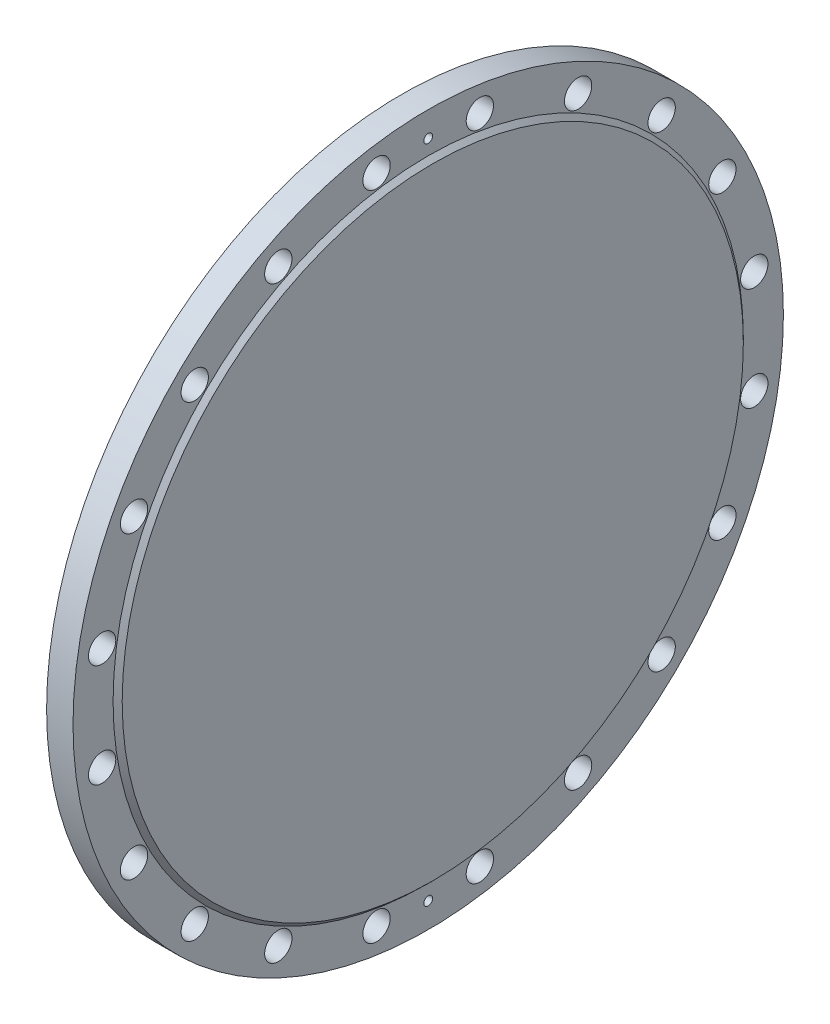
ISO-10303-21;
HEADER;
FILE_DESCRIPTION(('STEP AP214'),'2;1');
FILE_NAME('part.step','',(''),(''),'','','');
FILE_SCHEMA(('AUTOMOTIVE_DESIGN { 1 0 10303 214 1 1 1 1 }'));
ENDSEC;
DATA;
#1=APPLICATION_CONTEXT('core data for automotive mechanical design processes');
#2=APPLICATION_PROTOCOL_DEFINITION('international standard','automotive_design',2000,#1);
#3=PRODUCT_CONTEXT('',#1,'mechanical');
#4=PRODUCT('Part','Part','',(#3));
#5=PRODUCT_RELATED_PRODUCT_CATEGORY('part','',(#4));
#6=PRODUCT_DEFINITION_FORMATION('','',#4);
#7=PRODUCT_DEFINITION_CONTEXT('part definition',#1,'design');
#8=PRODUCT_DEFINITION('design','',#6,#7);
#9=PRODUCT_DEFINITION_SHAPE('','',#8);
#10=(LENGTH_UNIT() NAMED_UNIT(*) SI_UNIT(.MILLI.,.METRE.));
#11=(NAMED_UNIT(*) PLANE_ANGLE_UNIT() SI_UNIT($,.RADIAN.));
#12=(NAMED_UNIT(*) SI_UNIT($,.STERADIAN.) SOLID_ANGLE_UNIT());
#13=UNCERTAINTY_MEASURE_WITH_UNIT(LENGTH_MEASURE(1.E-05),#10,'distance_accuracy_value','');
#14=(GEOMETRIC_REPRESENTATION_CONTEXT(3) GLOBAL_UNCERTAINTY_ASSIGNED_CONTEXT((#13)) GLOBAL_UNIT_ASSIGNED_CONTEXT((#10,
#11,#12)) REPRESENTATION_CONTEXT('',''));
#15=CARTESIAN_POINT('',(0.,0.,0.));
#16=DIRECTION('',(0.,0.,1.));
#17=DIRECTION('',(1.,0.,0.));
#18=AXIS2_PLACEMENT_3D('',#15,#16,#17);
#19=CARTESIAN_POINT('',(-816.,390.,0.));
#20=DIRECTION('',(-1.,0.,0.));
#21=DIRECTION('',(0.,0.,1.));
#22=AXIS2_PLACEMENT_3D('',#19,#20,#21);
#23=PLANE('',#22);
#24=CARTESIAN_POINT('',(-816.,-362.5,0.));
#25=DIRECTION('',(-1.,0.,0.));
#26=DIRECTION('',(0.,0.,1.));
#27=AXIS2_PLACEMENT_3D('',#24,#25,#26);
#28=CIRCLE('',#27,4.80000000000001);
#29=CARTESIAN_POINT('',(-816.,-362.5,4.80000000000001));
#30=VERTEX_POINT('',#29);
#31=EDGE_CURVE('E151',#30,#30,#28,.T.);
#32=ORIENTED_EDGE('',*,*,#31,.F.);
#33=EDGE_LOOP('',(#32));
#34=FACE_BOUND('',#33,.T.);
#35=CARTESIAN_POINT('',(-816.,362.5,0.));
#36=DIRECTION('',(-1.,0.,0.));
#37=DIRECTION('',(0.,0.,1.));
#38=AXIS2_PLACEMENT_3D('',#35,#36,#37);
#39=CIRCLE('',#38,4.80000000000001);
#40=CARTESIAN_POINT('',(-816.,362.5,4.80000000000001));
#41=VERTEX_POINT('',#40);
#42=EDGE_CURVE('E141',#41,#41,#39,.T.);
#43=ORIENTED_EDGE('',*,*,#42,.F.);
#44=EDGE_LOOP('',(#43));
#45=FACE_BOUND('',#44,.T.);
#46=CARTESIAN_POINT('',(-816.,322.98986501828,164.571556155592));
#47=DIRECTION('',(-1.,0.,0.));
#48=DIRECTION('',(0.,0.,1.));
#49=AXIS2_PLACEMENT_3D('',#46,#47,#48);
#50=CIRCLE('',#49,15.);
#51=CARTESIAN_POINT('',(-816.,322.98986501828,179.571556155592));
#52=VERTEX_POINT('',#51);
#53=EDGE_CURVE('E138',#52,#52,#50,.T.);
#54=ORIENTED_EDGE('',*,*,#53,.F.);
#55=EDGE_LOOP('',(#54));
#56=FACE_BOUND('',#55,.T.);
#57=CARTESIAN_POINT('',(-816.,358.037023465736,56.7074935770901));
#58=DIRECTION('',(-1.,0.,0.));
#59=DIRECTION('',(0.,0.,1.));
#60=AXIS2_PLACEMENT_3D('',#57,#58,#59);
#61=CIRCLE('',#60,15.);
#62=CARTESIAN_POINT('',(-816.,358.037023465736,71.7074935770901));
#63=VERTEX_POINT('',#62);
#64=EDGE_CURVE('E135',#63,#63,#61,.T.);
#65=ORIENTED_EDGE('',*,*,#64,.F.);
#66=EDGE_LOOP('',(#65));
#67=FACE_BOUND('',#66,.T.);
#68=CARTESIAN_POINT('',(-816.,358.037023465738,-56.7074935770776));
#69=DIRECTION('',(-1.,0.,0.));
#70=DIRECTION('',(0.,0.,1.));
#71=AXIS2_PLACEMENT_3D('',#68,#69,#70);
#72=CIRCLE('',#71,15.);
#73=CARTESIAN_POINT('',(-816.,358.037023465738,-41.7074935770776));
#74=VERTEX_POINT('',#73);
#75=EDGE_CURVE('E131',#74,#74,#72,.T.);
#76=ORIENTED_EDGE('',*,*,#75,.F.);
#77=EDGE_LOOP('',(#76));
#78=FACE_BOUND('',#77,.T.);
#79=CARTESIAN_POINT('',(-816.,322.989865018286,-164.571556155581));
#80=DIRECTION('',(-1.,0.,0.));
#81=DIRECTION('',(0.,0.,1.));
#82=AXIS2_PLACEMENT_3D('',#79,#80,#81);
#83=CIRCLE('',#82,15.);
#84=CARTESIAN_POINT('',(-816.,322.989865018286,-149.571556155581));
#85=VERTEX_POINT('',#84);
#86=EDGE_CURVE('E127',#85,#85,#83,.T.);
#87=ORIENTED_EDGE('',*,*,#86,.F.);
#88=EDGE_LOOP('',(#87));
#89=FACE_BOUND('',#88,.T.);
#90=CARTESIAN_POINT('',(-816.,256.326208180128,-256.326208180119));
#91=DIRECTION('',(-1.,0.,0.));
#92=DIRECTION('',(0.,0.,1.));
#93=AXIS2_PLACEMENT_3D('',#90,#91,#92);
#94=CIRCLE('',#93,15.);
#95=CARTESIAN_POINT('',(-816.,256.326208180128,-241.326208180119));
#96=VERTEX_POINT('',#95);
#97=EDGE_CURVE('E123',#96,#96,#94,.T.);
#98=ORIENTED_EDGE('',*,*,#97,.F.);
#99=EDGE_LOOP('',(#98));
#100=FACE_BOUND('',#99,.T.);
#101=CARTESIAN_POINT('',(-816.,164.571556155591,-322.989865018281));
#102=DIRECTION('',(-1.,0.,0.));
#103=DIRECTION('',(0.,0.,1.));
#104=AXIS2_PLACEMENT_3D('',#101,#102,#103);
#105=CIRCLE('',#104,15.);
#106=CARTESIAN_POINT('',(-816.,164.571556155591,-307.989865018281));
#107=VERTEX_POINT('',#106);
#108=EDGE_CURVE('E119',#107,#107,#105,.T.);
#109=ORIENTED_EDGE('',*,*,#108,.F.);
#110=EDGE_LOOP('',(#109));
#111=FACE_BOUND('',#110,.T.);
#112=CARTESIAN_POINT('',(-816.,56.7074935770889,-358.037023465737));
#113=DIRECTION('',(-1.,0.,0.));
#114=DIRECTION('',(0.,0.,1.));
#115=AXIS2_PLACEMENT_3D('',#112,#113,#114);
#116=CIRCLE('',#115,15.0000000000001);
#117=CARTESIAN_POINT('',(-816.,56.7074935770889,-343.037023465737));
#118=VERTEX_POINT('',#117);
#119=EDGE_CURVE('E115',#118,#118,#116,.T.);
#120=ORIENTED_EDGE('',*,*,#119,.F.);
#121=EDGE_LOOP('',(#120));
#122=FACE_BOUND('',#121,.T.);
#123=CARTESIAN_POINT('',(-816.,-56.7074935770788,-358.037023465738));
#124=DIRECTION('',(-1.,0.,0.));
#125=DIRECTION('',(0.,0.,1.));
#126=AXIS2_PLACEMENT_3D('',#123,#124,#125);
#127=CIRCLE('',#126,15.0000000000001);
#128=CARTESIAN_POINT('',(-816.,-56.7074935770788,-343.037023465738));
#129=VERTEX_POINT('',#128);
#130=EDGE_CURVE('E111',#129,#129,#127,.T.);
#131=ORIENTED_EDGE('',*,*,#130,.F.);
#132=EDGE_LOOP('',(#131));
#133=FACE_BOUND('',#132,.T.);
#134=CARTESIAN_POINT('',(-816.,-164.571556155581,-322.989865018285));
#135=DIRECTION('',(-1.,0.,0.));
#136=DIRECTION('',(0.,0.,1.));
#137=AXIS2_PLACEMENT_3D('',#134,#135,#136);
#138=CIRCLE('',#137,15.);
#139=CARTESIAN_POINT('',(-816.,-164.571556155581,-307.989865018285));
#140=VERTEX_POINT('',#139);
#141=EDGE_CURVE('E107',#140,#140,#138,.T.);
#142=ORIENTED_EDGE('',*,*,#141,.F.);
#143=EDGE_LOOP('',(#142));
#144=FACE_BOUND('',#143,.T.);
#145=CARTESIAN_POINT('',(-816.,-256.32620818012,-256.326208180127));
#146=DIRECTION('',(-1.,0.,0.));
#147=DIRECTION('',(0.,0.,1.));
#148=AXIS2_PLACEMENT_3D('',#145,#146,#147);
#149=CIRCLE('',#148,15.);
#150=CARTESIAN_POINT('',(-816.,-256.32620818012,-241.326208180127));
#151=VERTEX_POINT('',#150);
#152=EDGE_CURVE('E103',#151,#151,#149,.T.);
#153=ORIENTED_EDGE('',*,*,#152,.F.);
#154=EDGE_LOOP('',(#153));
#155=FACE_BOUND('',#154,.T.);
#156=CARTESIAN_POINT('',(-816.,-322.989865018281,-164.571556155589));
#157=DIRECTION('',(-1.,0.,0.));
#158=DIRECTION('',(0.,0.,1.));
#159=AXIS2_PLACEMENT_3D('',#156,#157,#158);
#160=CIRCLE('',#159,15.);
#161=CARTESIAN_POINT('',(-816.,-322.989865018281,-149.571556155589));
#162=VERTEX_POINT('',#161);
#163=EDGE_CURVE('E99',#162,#162,#160,.T.);
#164=ORIENTED_EDGE('',*,*,#163,.F.);
#165=EDGE_LOOP('',(#164));
#166=FACE_BOUND('',#165,.T.);
#167=CARTESIAN_POINT('',(-816.,-358.037023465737,-56.7074935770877));
#168=DIRECTION('',(-1.,0.,0.));
#169=DIRECTION('',(0.,0.,1.));
#170=AXIS2_PLACEMENT_3D('',#167,#168,#169);
#171=CIRCLE('',#170,15.);
#172=CARTESIAN_POINT('',(-816.,-358.037023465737,-41.7074935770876));
#173=VERTEX_POINT('',#172);
#174=EDGE_CURVE('E95',#173,#173,#171,.T.);
#175=ORIENTED_EDGE('',*,*,#174,.F.);
#176=EDGE_LOOP('',(#175));
#177=FACE_BOUND('',#176,.T.);
#178=CARTESIAN_POINT('',(-816.,-358.037023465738,56.7074935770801));
#179=DIRECTION('',(-1.,0.,0.));
#180=DIRECTION('',(0.,0.,1.));
#181=AXIS2_PLACEMENT_3D('',#178,#179,#180);
#182=CIRCLE('',#181,15.);
#183=CARTESIAN_POINT('',(-816.,-358.037023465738,71.7074935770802));
#184=VERTEX_POINT('',#183);
#185=EDGE_CURVE('E91',#184,#184,#182,.T.);
#186=ORIENTED_EDGE('',*,*,#185,.F.);
#187=EDGE_LOOP('',(#186));
#188=FACE_BOUND('',#187,.T.);
#189=CARTESIAN_POINT('',(-816.,-322.989865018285,164.571556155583));
#190=DIRECTION('',(-1.,0.,0.));
#191=DIRECTION('',(0.,0.,1.));
#192=AXIS2_PLACEMENT_3D('',#189,#190,#191);
#193=CIRCLE('',#192,15.);
#194=CARTESIAN_POINT('',(-816.,-322.989865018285,179.571556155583));
#195=VERTEX_POINT('',#194);
#196=EDGE_CURVE('E87',#195,#195,#193,.T.);
#197=ORIENTED_EDGE('',*,*,#196,.F.);
#198=EDGE_LOOP('',(#197));
#199=FACE_BOUND('',#198,.T.);
#200=CARTESIAN_POINT('',(-816.,-256.326208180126,256.326208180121));
#201=DIRECTION('',(-1.,0.,0.));
#202=DIRECTION('',(0.,0.,1.));
#203=AXIS2_PLACEMENT_3D('',#200,#201,#202);
#204=CIRCLE('',#203,15.0000000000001);
#205=CARTESIAN_POINT('',(-816.,-256.326208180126,271.326208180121));
#206=VERTEX_POINT('',#205);
#207=EDGE_CURVE('E83',#206,#206,#204,.T.);
#208=ORIENTED_EDGE('',*,*,#207,.F.);
#209=EDGE_LOOP('',(#208));
#210=FACE_BOUND('',#209,.T.);
#211=CARTESIAN_POINT('',(-816.,-164.571556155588,322.989865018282));
#212=DIRECTION('',(-1.,0.,0.));
#213=DIRECTION('',(0.,0.,1.));
#214=AXIS2_PLACEMENT_3D('',#211,#212,#213);
#215=CIRCLE('',#214,15.);
#216=CARTESIAN_POINT('',(-816.,-164.571556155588,337.989865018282));
#217=VERTEX_POINT('',#216);
#218=EDGE_CURVE('E79',#217,#217,#215,.T.);
#219=ORIENTED_EDGE('',*,*,#218,.F.);
#220=EDGE_LOOP('',(#219));
#221=FACE_BOUND('',#220,.T.);
#222=CARTESIAN_POINT('',(-816.,-56.7074935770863,358.037023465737));
#223=DIRECTION('',(-1.,0.,0.));
#224=DIRECTION('',(0.,0.,1.));
#225=AXIS2_PLACEMENT_3D('',#222,#223,#224);
#226=CIRCLE('',#225,15.);
#227=CARTESIAN_POINT('',(-816.,-56.7074935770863,373.037023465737));
#228=VERTEX_POINT('',#227);
#229=EDGE_CURVE('E75',#228,#228,#226,.T.);
#230=ORIENTED_EDGE('',*,*,#229,.F.);
#231=EDGE_LOOP('',(#230));
#232=FACE_BOUND('',#231,.T.);
#233=CARTESIAN_POINT('',(-816.,56.7074935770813,358.037023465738));
#234=DIRECTION('',(-1.,0.,0.));
#235=DIRECTION('',(0.,0.,1.));
#236=AXIS2_PLACEMENT_3D('',#233,#234,#235);
#237=CIRCLE('',#236,15.);
#238=CARTESIAN_POINT('',(-816.,56.7074935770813,373.037023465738));
#239=VERTEX_POINT('',#238);
#240=EDGE_CURVE('E71',#239,#239,#237,.T.);
#241=ORIENTED_EDGE('',*,*,#240,.F.);
#242=EDGE_LOOP('',(#241));
#243=FACE_BOUND('',#242,.T.);
#244=CARTESIAN_POINT('',(-816.,164.571556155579,322.989865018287));
#245=DIRECTION('',(-1.,0.,0.));
#246=DIRECTION('',(0.,0.,1.));
#247=AXIS2_PLACEMENT_3D('',#244,#245,#246);
#248=CIRCLE('',#247,15.0000000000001);
#249=CARTESIAN_POINT('',(-816.,164.571556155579,337.989865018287));
#250=VERTEX_POINT('',#249);
#251=EDGE_CURVE('E67',#250,#250,#248,.T.);
#252=ORIENTED_EDGE('',*,*,#251,.F.);
#253=EDGE_LOOP('',(#252));
#254=FACE_BOUND('',#253,.T.);
#255=CARTESIAN_POINT('',(-816.,256.326208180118,256.326208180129));
#256=DIRECTION('',(-1.,0.,0.));
#257=DIRECTION('',(0.,0.,1.));
#258=AXIS2_PLACEMENT_3D('',#255,#256,#257);
#259=CIRCLE('',#258,15.);
#260=CARTESIAN_POINT('',(-816.,256.326208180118,271.326208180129));
#261=VERTEX_POINT('',#260);
#262=EDGE_CURVE('E63',#261,#261,#259,.T.);
#263=ORIENTED_EDGE('',*,*,#262,.F.);
#264=EDGE_LOOP('',(#263));
#265=FACE_BOUND('',#264,.T.);
#266=CARTESIAN_POINT('',(-816.,0.,0.));
#267=DIRECTION('',(1.,0.,0.));
#268=DIRECTION('',(0.,0.,-1.));
#269=AXIS2_PLACEMENT_3D('',#266,#267,#268);
#270=CIRCLE('',#269,390.);
#271=CARTESIAN_POINT('',(-816.,0.,-390.));
#272=VERTEX_POINT('',#271);
#273=EDGE_CURVE('E62',#272,#272,#270,.T.);
#274=ORIENTED_EDGE('',*,*,#273,.F.);
#275=EDGE_LOOP('',(#274));
#276=FACE_BOUND('',#275,.T.);
#277=ADVANCED_FACE('F43',(#34,#45,#56,#67,#78,#89,#100,#111,#122,#133,#144,#155,#166,#177,#188,
#199,#210,#221,#232,#243,#254,#265,#276),#23,.T.);
#278=CARTESIAN_POINT('',(-782.,341.,0.));
#279=DIRECTION('',(1.,0.,0.));
#280=DIRECTION('',(0.,0.,-1.));
#281=AXIS2_PLACEMENT_3D('',#278,#279,#280);
#282=PLANE('',#281);
#283=CARTESIAN_POINT('',(-782.,0.,0.));
#284=DIRECTION('',(1.,0.,0.));
#285=DIRECTION('',(0.,0.,-1.));
#286=AXIS2_PLACEMENT_3D('',#283,#284,#285);
#287=CIRCLE('',#286,341.);
#288=CARTESIAN_POINT('',(-782.,0.,-341.));
#289=VERTEX_POINT('',#288);
#290=EDGE_CURVE('E12',#289,#289,#287,.T.);
#291=ORIENTED_EDGE('',*,*,#290,.T.);
#292=EDGE_LOOP('',(#291));
#293=FACE_BOUND('',#292,.T.);
#294=ADVANCED_FACE('F215',(#293),#282,.T.);
#295=CARTESIAN_POINT('',(-782.,0.,0.));
#296=DIRECTION('',(-1.,0.,0.));
#297=DIRECTION('',(0.,0.,1.));
#298=AXIS2_PLACEMENT_3D('',#295,#296,#297);
#299=CONICAL_SURFACE('',#298,341.,0.785398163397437);
#300=CARTESIAN_POINT('',(-787.,0.,0.));
#301=DIRECTION('',(1.,0.,0.));
#302=DIRECTION('',(0.,0.,-1.));
#303=AXIS2_PLACEMENT_3D('',#300,#301,#302);
#304=CIRCLE('',#303,346.);
#305=CARTESIAN_POINT('',(-787.,0.,-346.));
#306=VERTEX_POINT('',#305);
#307=EDGE_CURVE('E50',#306,#306,#304,.T.);
#308=ORIENTED_EDGE('',*,*,#307,.T.);
#309=EDGE_LOOP('',(#308));
#310=FACE_BOUND('',#309,.T.);
#311=ORIENTED_EDGE('',*,*,#290,.F.);
#312=EDGE_LOOP('',(#311));
#313=FACE_BOUND('',#312,.T.);
#314=ADVANCED_FACE('F211',(#310,#313),#299,.T.);
#315=CARTESIAN_POINT('',(-787.,390.,0.));
#316=DIRECTION('',(1.,0.,0.));
#317=DIRECTION('',(0.,0.,-1.));
#318=AXIS2_PLACEMENT_3D('',#315,#316,#317);
#319=PLANE('',#318);
#320=CARTESIAN_POINT('',(-787.,-362.5,0.));
#321=DIRECTION('',(1.,0.,0.));
#322=DIRECTION('',(0.,0.,-1.));
#323=AXIS2_PLACEMENT_3D('',#320,#321,#322);
#324=CIRCLE('',#323,4.80000000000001);
#325=CARTESIAN_POINT('',(-787.,-362.5,-4.80000000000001));
#326=VERTEX_POINT('',#325);
#327=EDGE_CURVE('E46',#326,#326,#324,.T.);
#328=ORIENTED_EDGE('',*,*,#327,.F.);
#329=EDGE_LOOP('',(#328));
#330=FACE_BOUND('',#329,.T.);
#331=CARTESIAN_POINT('',(-787.,362.5,0.));
#332=DIRECTION('',(1.,0.,0.));
#333=DIRECTION('',(0.,0.,-1.));
#334=AXIS2_PLACEMENT_3D('',#331,#332,#333);
#335=CIRCLE('',#334,4.80000000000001);
#336=CARTESIAN_POINT('',(-787.,362.5,-4.80000000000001));
#337=VERTEX_POINT('',#336);
#338=EDGE_CURVE('E139',#337,#337,#335,.T.);
#339=ORIENTED_EDGE('',*,*,#338,.F.);
#340=EDGE_LOOP('',(#339));
#341=FACE_BOUND('',#340,.T.);
#342=CARTESIAN_POINT('',(-787.,322.98986501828,164.571556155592));
#343=DIRECTION('',(1.,0.,0.));
#344=DIRECTION('',(0.,0.,-1.));
#345=AXIS2_PLACEMENT_3D('',#342,#343,#344);
#346=CIRCLE('',#345,15.);
#347=CARTESIAN_POINT('',(-787.,322.98986501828,149.571556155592));
#348=VERTEX_POINT('',#347);
#349=EDGE_CURVE('E136',#348,#348,#346,.T.);
#350=ORIENTED_EDGE('',*,*,#349,.F.);
#351=EDGE_LOOP('',(#350));
#352=FACE_BOUND('',#351,.T.);
#353=CARTESIAN_POINT('',(-787.,358.037023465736,56.7074935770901));
#354=DIRECTION('',(1.,0.,0.));
#355=DIRECTION('',(0.,0.,-1.));
#356=AXIS2_PLACEMENT_3D('',#353,#354,#355);
#357=CIRCLE('',#356,15.);
#358=CARTESIAN_POINT('',(-787.,358.037023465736,41.70749357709));
#359=VERTEX_POINT('',#358);
#360=EDGE_CURVE('E132',#359,#359,#357,.T.);
#361=ORIENTED_EDGE('',*,*,#360,.F.);
#362=EDGE_LOOP('',(#361));
#363=FACE_BOUND('',#362,.T.);
#364=CARTESIAN_POINT('',(-787.,358.037023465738,-56.7074935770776));
#365=DIRECTION('',(1.,0.,0.));
#366=DIRECTION('',(0.,0.,-1.));
#367=AXIS2_PLACEMENT_3D('',#364,#365,#366);
#368=CIRCLE('',#367,15.);
#369=CARTESIAN_POINT('',(-787.,358.037023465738,-71.7074935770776));
#370=VERTEX_POINT('',#369);
#371=EDGE_CURVE('E128',#370,#370,#368,.T.);
#372=ORIENTED_EDGE('',*,*,#371,.F.);
#373=EDGE_LOOP('',(#372));
#374=FACE_BOUND('',#373,.T.);
#375=CARTESIAN_POINT('',(-787.,322.989865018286,-164.571556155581));
#376=DIRECTION('',(1.,0.,0.));
#377=DIRECTION('',(0.,0.,-1.));
#378=AXIS2_PLACEMENT_3D('',#375,#376,#377);
#379=CIRCLE('',#378,15.);
#380=CARTESIAN_POINT('',(-787.,322.989865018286,-179.571556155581));
#381=VERTEX_POINT('',#380);
#382=EDGE_CURVE('E124',#381,#381,#379,.T.);
#383=ORIENTED_EDGE('',*,*,#382,.F.);
#384=EDGE_LOOP('',(#383));
#385=FACE_BOUND('',#384,.T.);
#386=CARTESIAN_POINT('',(-787.,256.326208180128,-256.326208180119));
#387=DIRECTION('',(1.,0.,0.));
#388=DIRECTION('',(0.,0.,-1.));
#389=AXIS2_PLACEMENT_3D('',#386,#387,#388);
#390=CIRCLE('',#389,15.);
#391=CARTESIAN_POINT('',(-787.,256.326208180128,-271.326208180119));
#392=VERTEX_POINT('',#391);
#393=EDGE_CURVE('E120',#392,#392,#390,.T.);
#394=ORIENTED_EDGE('',*,*,#393,.F.);
#395=EDGE_LOOP('',(#394));
#396=FACE_BOUND('',#395,.T.);
#397=CARTESIAN_POINT('',(-787.,164.571556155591,-322.989865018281));
#398=DIRECTION('',(1.,0.,0.));
#399=DIRECTION('',(0.,0.,-1.));
#400=AXIS2_PLACEMENT_3D('',#397,#398,#399);
#401=CIRCLE('',#400,15.);
#402=CARTESIAN_POINT('',(-787.,164.571556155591,-337.989865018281));
#403=VERTEX_POINT('',#402);
#404=EDGE_CURVE('E116',#403,#403,#401,.T.);
#405=ORIENTED_EDGE('',*,*,#404,.F.);
#406=EDGE_LOOP('',(#405));
#407=FACE_BOUND('',#406,.T.);
#408=CARTESIAN_POINT('',(-787.,56.7074935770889,-358.037023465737));
#409=DIRECTION('',(1.,0.,0.));
#410=DIRECTION('',(0.,0.,-1.));
#411=AXIS2_PLACEMENT_3D('',#408,#409,#410);
#412=CIRCLE('',#411,15.0000000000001);
#413=CARTESIAN_POINT('',(-787.,56.7074935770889,-373.037023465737));
#414=VERTEX_POINT('',#413);
#415=EDGE_CURVE('E112',#414,#414,#412,.T.);
#416=ORIENTED_EDGE('',*,*,#415,.F.);
#417=EDGE_LOOP('',(#416));
#418=FACE_BOUND('',#417,.T.);
#419=CARTESIAN_POINT('',(-787.,-56.7074935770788,-358.037023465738));
#420=DIRECTION('',(1.,0.,0.));
#421=DIRECTION('',(0.,0.,-1.));
#422=AXIS2_PLACEMENT_3D('',#419,#420,#421);
#423=CIRCLE('',#422,15.0000000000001);
#424=CARTESIAN_POINT('',(-787.,-56.7074935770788,-373.037023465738));
#425=VERTEX_POINT('',#424);
#426=EDGE_CURVE('E108',#425,#425,#423,.T.);
#427=ORIENTED_EDGE('',*,*,#426,.F.);
#428=EDGE_LOOP('',(#427));
#429=FACE_BOUND('',#428,.T.);
#430=CARTESIAN_POINT('',(-787.,-164.571556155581,-322.989865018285));
#431=DIRECTION('',(1.,0.,0.));
#432=DIRECTION('',(0.,0.,-1.));
#433=AXIS2_PLACEMENT_3D('',#430,#431,#432);
#434=CIRCLE('',#433,15.);
#435=CARTESIAN_POINT('',(-787.,-164.571556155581,-337.989865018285));
#436=VERTEX_POINT('',#435);
#437=EDGE_CURVE('E104',#436,#436,#434,.T.);
#438=ORIENTED_EDGE('',*,*,#437,.F.);
#439=EDGE_LOOP('',(#438));
#440=FACE_BOUND('',#439,.T.);
#441=CARTESIAN_POINT('',(-787.,-256.32620818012,-256.326208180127));
#442=DIRECTION('',(1.,0.,0.));
#443=DIRECTION('',(0.,0.,-1.));
#444=AXIS2_PLACEMENT_3D('',#441,#442,#443);
#445=CIRCLE('',#444,15.);
#446=CARTESIAN_POINT('',(-787.,-256.32620818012,-271.326208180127));
#447=VERTEX_POINT('',#446);
#448=EDGE_CURVE('E100',#447,#447,#445,.T.);
#449=ORIENTED_EDGE('',*,*,#448,.F.);
#450=EDGE_LOOP('',(#449));
#451=FACE_BOUND('',#450,.T.);
#452=CARTESIAN_POINT('',(-787.,-322.989865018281,-164.571556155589));
#453=DIRECTION('',(1.,0.,0.));
#454=DIRECTION('',(0.,0.,-1.));
#455=AXIS2_PLACEMENT_3D('',#452,#453,#454);
#456=CIRCLE('',#455,15.);
#457=CARTESIAN_POINT('',(-787.,-322.989865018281,-179.571556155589));
#458=VERTEX_POINT('',#457);
#459=EDGE_CURVE('E96',#458,#458,#456,.T.);
#460=ORIENTED_EDGE('',*,*,#459,.F.);
#461=EDGE_LOOP('',(#460));
#462=FACE_BOUND('',#461,.T.);
#463=CARTESIAN_POINT('',(-787.,-358.037023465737,-56.7074935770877));
#464=DIRECTION('',(1.,0.,0.));
#465=DIRECTION('',(0.,0.,-1.));
#466=AXIS2_PLACEMENT_3D('',#463,#464,#465);
#467=CIRCLE('',#466,15.);
#468=CARTESIAN_POINT('',(-787.,-358.037023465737,-71.7074935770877));
#469=VERTEX_POINT('',#468);
#470=EDGE_CURVE('E92',#469,#469,#467,.T.);
#471=ORIENTED_EDGE('',*,*,#470,.F.);
#472=EDGE_LOOP('',(#471));
#473=FACE_BOUND('',#472,.T.);
#474=CARTESIAN_POINT('',(-787.,-358.037023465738,56.7074935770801));
#475=DIRECTION('',(1.,0.,0.));
#476=DIRECTION('',(0.,0.,-1.));
#477=AXIS2_PLACEMENT_3D('',#474,#475,#476);
#478=CIRCLE('',#477,15.);
#479=CARTESIAN_POINT('',(-787.,-358.037023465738,41.7074935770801));
#480=VERTEX_POINT('',#479);
#481=EDGE_CURVE('E88',#480,#480,#478,.T.);
#482=ORIENTED_EDGE('',*,*,#481,.F.);
#483=EDGE_LOOP('',(#482));
#484=FACE_BOUND('',#483,.T.);
#485=CARTESIAN_POINT('',(-787.,-322.989865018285,164.571556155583));
#486=DIRECTION('',(1.,0.,0.));
#487=DIRECTION('',(0.,0.,-1.));
#488=AXIS2_PLACEMENT_3D('',#485,#486,#487);
#489=CIRCLE('',#488,15.);
#490=CARTESIAN_POINT('',(-787.,-322.989865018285,149.571556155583));
#491=VERTEX_POINT('',#490);
#492=EDGE_CURVE('E84',#491,#491,#489,.T.);
#493=ORIENTED_EDGE('',*,*,#492,.F.);
#494=EDGE_LOOP('',(#493));
#495=FACE_BOUND('',#494,.T.);
#496=CARTESIAN_POINT('',(-787.,-256.326208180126,256.326208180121));
#497=DIRECTION('',(1.,0.,0.));
#498=DIRECTION('',(0.,0.,-1.));
#499=AXIS2_PLACEMENT_3D('',#496,#497,#498);
#500=CIRCLE('',#499,15.0000000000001);
#501=CARTESIAN_POINT('',(-787.,-256.326208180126,241.326208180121));
#502=VERTEX_POINT('',#501);
#503=EDGE_CURVE('E80',#502,#502,#500,.T.);
#504=ORIENTED_EDGE('',*,*,#503,.F.);
#505=EDGE_LOOP('',(#504));
#506=FACE_BOUND('',#505,.T.);
#507=CARTESIAN_POINT('',(-787.,-164.571556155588,322.989865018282));
#508=DIRECTION('',(1.,0.,0.));
#509=DIRECTION('',(0.,0.,-1.));
#510=AXIS2_PLACEMENT_3D('',#507,#508,#509);
#511=CIRCLE('',#510,15.);
#512=CARTESIAN_POINT('',(-787.,-164.571556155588,307.989865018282));
#513=VERTEX_POINT('',#512);
#514=EDGE_CURVE('E76',#513,#513,#511,.T.);
#515=ORIENTED_EDGE('',*,*,#514,.F.);
#516=EDGE_LOOP('',(#515));
#517=FACE_BOUND('',#516,.T.);
#518=CARTESIAN_POINT('',(-787.,-56.7074935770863,358.037023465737));
#519=DIRECTION('',(1.,0.,0.));
#520=DIRECTION('',(0.,0.,-1.));
#521=AXIS2_PLACEMENT_3D('',#518,#519,#520);
#522=CIRCLE('',#521,15.);
#523=CARTESIAN_POINT('',(-787.,-56.7074935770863,343.037023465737));
#524=VERTEX_POINT('',#523);
#525=EDGE_CURVE('E72',#524,#524,#522,.T.);
#526=ORIENTED_EDGE('',*,*,#525,.F.);
#527=EDGE_LOOP('',(#526));
#528=FACE_BOUND('',#527,.T.);
#529=CARTESIAN_POINT('',(-787.,56.7074935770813,358.037023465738));
#530=DIRECTION('',(1.,0.,0.));
#531=DIRECTION('',(0.,0.,-1.));
#532=AXIS2_PLACEMENT_3D('',#529,#530,#531);
#533=CIRCLE('',#532,15.);
#534=CARTESIAN_POINT('',(-787.,56.7074935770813,343.037023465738));
#535=VERTEX_POINT('',#534);
#536=EDGE_CURVE('E68',#535,#535,#533,.T.);
#537=ORIENTED_EDGE('',*,*,#536,.F.);
#538=EDGE_LOOP('',(#537));
#539=FACE_BOUND('',#538,.T.);
#540=CARTESIAN_POINT('',(-787.,164.571556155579,322.989865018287));
#541=DIRECTION('',(1.,0.,0.));
#542=DIRECTION('',(0.,0.,-1.));
#543=AXIS2_PLACEMENT_3D('',#540,#541,#542);
#544=CIRCLE('',#543,15.0000000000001);
#545=CARTESIAN_POINT('',(-787.,164.571556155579,307.989865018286));
#546=VERTEX_POINT('',#545);
#547=EDGE_CURVE('E64',#546,#546,#544,.T.);
#548=ORIENTED_EDGE('',*,*,#547,.F.);
#549=EDGE_LOOP('',(#548));
#550=FACE_BOUND('',#549,.T.);
#551=CARTESIAN_POINT('',(-787.,256.326208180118,256.326208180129));
#552=DIRECTION('',(1.,0.,0.));
#553=DIRECTION('',(0.,0.,-1.));
#554=AXIS2_PLACEMENT_3D('',#551,#552,#553);
#555=CIRCLE('',#554,15.);
#556=CARTESIAN_POINT('',(-787.,256.326208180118,241.326208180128));
#557=VERTEX_POINT('',#556);
#558=EDGE_CURVE('E59',#557,#557,#555,.T.);
#559=ORIENTED_EDGE('',*,*,#558,.F.);
#560=EDGE_LOOP('',(#559));
#561=FACE_BOUND('',#560,.T.);
#562=CARTESIAN_POINT('',(-787.,0.,0.));
#563=DIRECTION('',(1.,0.,0.));
#564=DIRECTION('',(0.,0.,-1.));
#565=AXIS2_PLACEMENT_3D('',#562,#563,#564);
#566=CIRCLE('',#565,390.);
#567=CARTESIAN_POINT('',(-787.,0.,-390.));
#568=VERTEX_POINT('',#567);
#569=EDGE_CURVE('E55',#568,#568,#566,.T.);
#570=ORIENTED_EDGE('',*,*,#569,.T.);
#571=EDGE_LOOP('',(#570));
#572=FACE_BOUND('',#571,.T.);
#573=ORIENTED_EDGE('',*,*,#307,.F.);
#574=EDGE_LOOP('',(#573));
#575=FACE_BOUND('',#574,.T.);
#576=ADVANCED_FACE('F196',(#330,#341,#352,#363,#374,#385,#396,#407,#418,#429,#440,#451,#462,
#473,#484,#495,#506,#517,#528,#539,#550,#561,#572,#575),#319,.T.);
#577=CARTESIAN_POINT('',(0.,0.,0.));
#578=DIRECTION('',(1.,0.,0.));
#579=DIRECTION('',(0.,0.,-1.));
#580=AXIS2_PLACEMENT_3D('',#577,#578,#579);
#581=CYLINDRICAL_SURFACE('',#580,390.);
#582=ORIENTED_EDGE('',*,*,#273,.T.);
#583=EDGE_LOOP('',(#582));
#584=FACE_BOUND('',#583,.T.);
#585=ORIENTED_EDGE('',*,*,#569,.F.);
#586=EDGE_LOOP('',(#585));
#587=FACE_BOUND('',#586,.T.);
#588=ADVANCED_FACE('F199',(#584,#587),#581,.T.);
#589=CARTESIAN_POINT('',(-782.,256.326208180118,256.326208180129));
#590=DIRECTION('',(-1.,0.,0.));
#591=DIRECTION('',(0.,0.,1.));
#592=AXIS2_PLACEMENT_3D('',#589,#590,#591);
#593=CYLINDRICAL_SURFACE('',#592,15.);
#594=ORIENTED_EDGE('',*,*,#558,.T.);
#595=EDGE_LOOP('',(#594));
#596=FACE_BOUND('',#595,.T.);
#597=ORIENTED_EDGE('',*,*,#262,.T.);
#598=EDGE_LOOP('',(#597));
#599=FACE_BOUND('',#598,.T.);
#600=ADVANCED_FACE('F201',(#596,#599),#593,.F.);
#601=CARTESIAN_POINT('',(-782.,164.571556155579,322.989865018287));
#602=DIRECTION('',(-1.,0.,0.));
#603=DIRECTION('',(0.,0.,1.));
#604=AXIS2_PLACEMENT_3D('',#601,#602,#603);
#605=CYLINDRICAL_SURFACE('',#604,15.0000000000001);
#606=ORIENTED_EDGE('',*,*,#547,.T.);
#607=EDGE_LOOP('',(#606));
#608=FACE_BOUND('',#607,.T.);
#609=ORIENTED_EDGE('',*,*,#251,.T.);
#610=EDGE_LOOP('',(#609));
#611=FACE_BOUND('',#610,.T.);
#612=ADVANCED_FACE('F208',(#608,#611),#605,.F.);
#613=CARTESIAN_POINT('',(-782.,56.7074935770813,358.037023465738));
#614=DIRECTION('',(-1.,0.,0.));
#615=DIRECTION('',(0.,0.,1.));
#616=AXIS2_PLACEMENT_3D('',#613,#614,#615);
#617=CYLINDRICAL_SURFACE('',#616,15.);
#618=ORIENTED_EDGE('',*,*,#536,.T.);
#619=EDGE_LOOP('',(#618));
#620=FACE_BOUND('',#619,.T.);
#621=ORIENTED_EDGE('',*,*,#240,.T.);
#622=EDGE_LOOP('',(#621));
#623=FACE_BOUND('',#622,.T.);
#624=ADVANCED_FACE('F268',(#620,#623),#617,.F.);
#625=CARTESIAN_POINT('',(-782.,-56.7074935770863,358.037023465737));
#626=DIRECTION('',(-1.,0.,0.));
#627=DIRECTION('',(0.,0.,1.));
#628=AXIS2_PLACEMENT_3D('',#625,#626,#627);
#629=CYLINDRICAL_SURFACE('',#628,15.);
#630=ORIENTED_EDGE('',*,*,#525,.T.);
#631=EDGE_LOOP('',(#630));
#632=FACE_BOUND('',#631,.T.);
#633=ORIENTED_EDGE('',*,*,#229,.T.);
#634=EDGE_LOOP('',(#633));
#635=FACE_BOUND('',#634,.T.);
#636=ADVANCED_FACE('F274',(#632,#635),#629,.F.);
#637=CARTESIAN_POINT('',(-782.,-164.571556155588,322.989865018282));
#638=DIRECTION('',(-1.,0.,0.));
#639=DIRECTION('',(0.,0.,1.));
#640=AXIS2_PLACEMENT_3D('',#637,#638,#639);
#641=CYLINDRICAL_SURFACE('',#640,15.);
#642=ORIENTED_EDGE('',*,*,#514,.T.);
#643=EDGE_LOOP('',(#642));
#644=FACE_BOUND('',#643,.T.);
#645=ORIENTED_EDGE('',*,*,#218,.T.);
#646=EDGE_LOOP('',(#645));
#647=FACE_BOUND('',#646,.T.);
#648=ADVANCED_FACE('F280',(#644,#647),#641,.F.);
#649=CARTESIAN_POINT('',(-782.,-256.326208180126,256.326208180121));
#650=DIRECTION('',(-1.,0.,0.));
#651=DIRECTION('',(0.,0.,1.));
#652=AXIS2_PLACEMENT_3D('',#649,#650,#651);
#653=CYLINDRICAL_SURFACE('',#652,15.0000000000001);
#654=ORIENTED_EDGE('',*,*,#503,.T.);
#655=EDGE_LOOP('',(#654));
#656=FACE_BOUND('',#655,.T.);
#657=ORIENTED_EDGE('',*,*,#207,.T.);
#658=EDGE_LOOP('',(#657));
#659=FACE_BOUND('',#658,.T.);
#660=ADVANCED_FACE('F284',(#656,#659),#653,.F.);
#661=CARTESIAN_POINT('',(-782.,-322.989865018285,164.571556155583));
#662=DIRECTION('',(-1.,0.,0.));
#663=DIRECTION('',(0.,0.,1.));
#664=AXIS2_PLACEMENT_3D('',#661,#662,#663);
#665=CYLINDRICAL_SURFACE('',#664,15.);
#666=ORIENTED_EDGE('',*,*,#492,.T.);
#667=EDGE_LOOP('',(#666));
#668=FACE_BOUND('',#667,.T.);
#669=ORIENTED_EDGE('',*,*,#196,.T.);
#670=EDGE_LOOP('',(#669));
#671=FACE_BOUND('',#670,.T.);
#672=ADVANCED_FACE('F288',(#668,#671),#665,.F.);
#673=CARTESIAN_POINT('',(-782.,-358.037023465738,56.7074935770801));
#674=DIRECTION('',(-1.,0.,0.));
#675=DIRECTION('',(0.,0.,1.));
#676=AXIS2_PLACEMENT_3D('',#673,#674,#675);
#677=CYLINDRICAL_SURFACE('',#676,15.);
#678=ORIENTED_EDGE('',*,*,#481,.T.);
#679=EDGE_LOOP('',(#678));
#680=FACE_BOUND('',#679,.T.);
#681=ORIENTED_EDGE('',*,*,#185,.T.);
#682=EDGE_LOOP('',(#681));
#683=FACE_BOUND('',#682,.T.);
#684=ADVANCED_FACE('F292',(#680,#683),#677,.F.);
#685=CARTESIAN_POINT('',(-782.,-358.037023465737,-56.7074935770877));
#686=DIRECTION('',(-1.,0.,0.));
#687=DIRECTION('',(0.,0.,1.));
#688=AXIS2_PLACEMENT_3D('',#685,#686,#687);
#689=CYLINDRICAL_SURFACE('',#688,15.);
#690=ORIENTED_EDGE('',*,*,#470,.T.);
#691=EDGE_LOOP('',(#690));
#692=FACE_BOUND('',#691,.T.);
#693=ORIENTED_EDGE('',*,*,#174,.T.);
#694=EDGE_LOOP('',(#693));
#695=FACE_BOUND('',#694,.T.);
#696=ADVANCED_FACE('F296',(#692,#695),#689,.F.);
#697=CARTESIAN_POINT('',(-782.,-322.989865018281,-164.571556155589));
#698=DIRECTION('',(-1.,0.,0.));
#699=DIRECTION('',(0.,0.,1.));
#700=AXIS2_PLACEMENT_3D('',#697,#698,#699);
#701=CYLINDRICAL_SURFACE('',#700,15.);
#702=ORIENTED_EDGE('',*,*,#459,.T.);
#703=EDGE_LOOP('',(#702));
#704=FACE_BOUND('',#703,.T.);
#705=ORIENTED_EDGE('',*,*,#163,.T.);
#706=EDGE_LOOP('',(#705));
#707=FACE_BOUND('',#706,.T.);
#708=ADVANCED_FACE('F300',(#704,#707),#701,.F.);
#709=CARTESIAN_POINT('',(-782.,-256.32620818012,-256.326208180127));
#710=DIRECTION('',(-1.,0.,0.));
#711=DIRECTION('',(0.,0.,1.));
#712=AXIS2_PLACEMENT_3D('',#709,#710,#711);
#713=CYLINDRICAL_SURFACE('',#712,15.);
#714=ORIENTED_EDGE('',*,*,#448,.T.);
#715=EDGE_LOOP('',(#714));
#716=FACE_BOUND('',#715,.T.);
#717=ORIENTED_EDGE('',*,*,#152,.T.);
#718=EDGE_LOOP('',(#717));
#719=FACE_BOUND('',#718,.T.);
#720=ADVANCED_FACE('F304',(#716,#719),#713,.F.);
#721=CARTESIAN_POINT('',(-782.,-164.571556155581,-322.989865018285));
#722=DIRECTION('',(-1.,0.,0.));
#723=DIRECTION('',(0.,0.,1.));
#724=AXIS2_PLACEMENT_3D('',#721,#722,#723);
#725=CYLINDRICAL_SURFACE('',#724,15.);
#726=ORIENTED_EDGE('',*,*,#437,.T.);
#727=EDGE_LOOP('',(#726));
#728=FACE_BOUND('',#727,.T.);
#729=ORIENTED_EDGE('',*,*,#141,.T.);
#730=EDGE_LOOP('',(#729));
#731=FACE_BOUND('',#730,.T.);
#732=ADVANCED_FACE('F308',(#728,#731),#725,.F.);
#733=CARTESIAN_POINT('',(-782.,-56.7074935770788,-358.037023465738));
#734=DIRECTION('',(-1.,0.,0.));
#735=DIRECTION('',(0.,0.,1.));
#736=AXIS2_PLACEMENT_3D('',#733,#734,#735);
#737=CYLINDRICAL_SURFACE('',#736,15.0000000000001);
#738=ORIENTED_EDGE('',*,*,#426,.T.);
#739=EDGE_LOOP('',(#738));
#740=FACE_BOUND('',#739,.T.);
#741=ORIENTED_EDGE('',*,*,#130,.T.);
#742=EDGE_LOOP('',(#741));
#743=FACE_BOUND('',#742,.T.);
#744=ADVANCED_FACE('F312',(#740,#743),#737,.F.);
#745=CARTESIAN_POINT('',(-782.,56.7074935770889,-358.037023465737));
#746=DIRECTION('',(-1.,0.,0.));
#747=DIRECTION('',(0.,0.,1.));
#748=AXIS2_PLACEMENT_3D('',#745,#746,#747);
#749=CYLINDRICAL_SURFACE('',#748,15.0000000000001);
#750=ORIENTED_EDGE('',*,*,#415,.T.);
#751=EDGE_LOOP('',(#750));
#752=FACE_BOUND('',#751,.T.);
#753=ORIENTED_EDGE('',*,*,#119,.T.);
#754=EDGE_LOOP('',(#753));
#755=FACE_BOUND('',#754,.T.);
#756=ADVANCED_FACE('F316',(#752,#755),#749,.F.);
#757=CARTESIAN_POINT('',(-782.,164.571556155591,-322.989865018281));
#758=DIRECTION('',(-1.,0.,0.));
#759=DIRECTION('',(0.,0.,1.));
#760=AXIS2_PLACEMENT_3D('',#757,#758,#759);
#761=CYLINDRICAL_SURFACE('',#760,15.);
#762=ORIENTED_EDGE('',*,*,#404,.T.);
#763=EDGE_LOOP('',(#762));
#764=FACE_BOUND('',#763,.T.);
#765=ORIENTED_EDGE('',*,*,#108,.T.);
#766=EDGE_LOOP('',(#765));
#767=FACE_BOUND('',#766,.T.);
#768=ADVANCED_FACE('F320',(#764,#767),#761,.F.);
#769=CARTESIAN_POINT('',(-782.,256.326208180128,-256.326208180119));
#770=DIRECTION('',(-1.,0.,0.));
#771=DIRECTION('',(0.,0.,1.));
#772=AXIS2_PLACEMENT_3D('',#769,#770,#771);
#773=CYLINDRICAL_SURFACE('',#772,15.);
#774=ORIENTED_EDGE('',*,*,#393,.T.);
#775=EDGE_LOOP('',(#774));
#776=FACE_BOUND('',#775,.T.);
#777=ORIENTED_EDGE('',*,*,#97,.T.);
#778=EDGE_LOOP('',(#777));
#779=FACE_BOUND('',#778,.T.);
#780=ADVANCED_FACE('F324',(#776,#779),#773,.F.);
#781=CARTESIAN_POINT('',(-782.,322.989865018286,-164.571556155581));
#782=DIRECTION('',(-1.,0.,0.));
#783=DIRECTION('',(0.,0.,1.));
#784=AXIS2_PLACEMENT_3D('',#781,#782,#783);
#785=CYLINDRICAL_SURFACE('',#784,15.);
#786=ORIENTED_EDGE('',*,*,#382,.T.);
#787=EDGE_LOOP('',(#786));
#788=FACE_BOUND('',#787,.T.);
#789=ORIENTED_EDGE('',*,*,#86,.T.);
#790=EDGE_LOOP('',(#789));
#791=FACE_BOUND('',#790,.T.);
#792=ADVANCED_FACE('F328',(#788,#791),#785,.F.);
#793=CARTESIAN_POINT('',(-782.,358.037023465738,-56.7074935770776));
#794=DIRECTION('',(-1.,0.,0.));
#795=DIRECTION('',(0.,0.,1.));
#796=AXIS2_PLACEMENT_3D('',#793,#794,#795);
#797=CYLINDRICAL_SURFACE('',#796,15.);
#798=ORIENTED_EDGE('',*,*,#371,.T.);
#799=EDGE_LOOP('',(#798));
#800=FACE_BOUND('',#799,.T.);
#801=ORIENTED_EDGE('',*,*,#75,.T.);
#802=EDGE_LOOP('',(#801));
#803=FACE_BOUND('',#802,.T.);
#804=ADVANCED_FACE('F332',(#800,#803),#797,.F.);
#805=CARTESIAN_POINT('',(-782.,358.037023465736,56.7074935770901));
#806=DIRECTION('',(-1.,0.,0.));
#807=DIRECTION('',(0.,0.,1.));
#808=AXIS2_PLACEMENT_3D('',#805,#806,#807);
#809=CYLINDRICAL_SURFACE('',#808,15.);
#810=ORIENTED_EDGE('',*,*,#360,.T.);
#811=EDGE_LOOP('',(#810));
#812=FACE_BOUND('',#811,.T.);
#813=ORIENTED_EDGE('',*,*,#64,.T.);
#814=EDGE_LOOP('',(#813));
#815=FACE_BOUND('',#814,.T.);
#816=ADVANCED_FACE('F336',(#812,#815),#809,.F.);
#817=CARTESIAN_POINT('',(-782.,322.98986501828,164.571556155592));
#818=DIRECTION('',(-1.,0.,0.));
#819=DIRECTION('',(0.,0.,1.));
#820=AXIS2_PLACEMENT_3D('',#817,#818,#819);
#821=CYLINDRICAL_SURFACE('',#820,15.);
#822=ORIENTED_EDGE('',*,*,#349,.T.);
#823=EDGE_LOOP('',(#822));
#824=FACE_BOUND('',#823,.T.);
#825=ORIENTED_EDGE('',*,*,#53,.T.);
#826=EDGE_LOOP('',(#825));
#827=FACE_BOUND('',#826,.T.);
#828=ADVANCED_FACE('F340',(#824,#827),#821,.F.);
#829=CARTESIAN_POINT('',(-782.,362.5,0.));
#830=DIRECTION('',(-1.,0.,0.));
#831=DIRECTION('',(0.,0.,1.));
#832=AXIS2_PLACEMENT_3D('',#829,#830,#831);
#833=CYLINDRICAL_SURFACE('',#832,4.80000000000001);
#834=ORIENTED_EDGE('',*,*,#338,.T.);
#835=EDGE_LOOP('',(#834));
#836=FACE_BOUND('',#835,.T.);
#837=ORIENTED_EDGE('',*,*,#42,.T.);
#838=EDGE_LOOP('',(#837));
#839=FACE_BOUND('',#838,.T.);
#840=ADVANCED_FACE('F344',(#836,#839),#833,.F.);
#841=CARTESIAN_POINT('',(-782.,-362.5,0.));
#842=DIRECTION('',(-1.,0.,0.));
#843=DIRECTION('',(0.,0.,1.));
#844=AXIS2_PLACEMENT_3D('',#841,#842,#843);
#845=CYLINDRICAL_SURFACE('',#844,4.80000000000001);
#846=ORIENTED_EDGE('',*,*,#327,.T.);
#847=EDGE_LOOP('',(#846));
#848=FACE_BOUND('',#847,.T.);
#849=ORIENTED_EDGE('',*,*,#31,.T.);
#850=EDGE_LOOP('',(#849));
#851=FACE_BOUND('',#850,.T.);
#852=ADVANCED_FACE('F348',(#848,#851),#845,.F.);
#853=CLOSED_SHELL('',(#277,#294,#314,#576,#588,#600,#612,#624,#636,#648,#660,#672,#684,#696,
#708,#720,#732,#744,#756,#768,#780,#792,#804,#816,#828,#840,#852));
#854=MANIFOLD_SOLID_BREP('B2',#853);
#855=ADVANCED_BREP_SHAPE_REPRESENTATION('',(#18,#854),#14);
#856=SHAPE_DEFINITION_REPRESENTATION(#9,#855);
ENDSEC;
END-ISO-10303-21;
